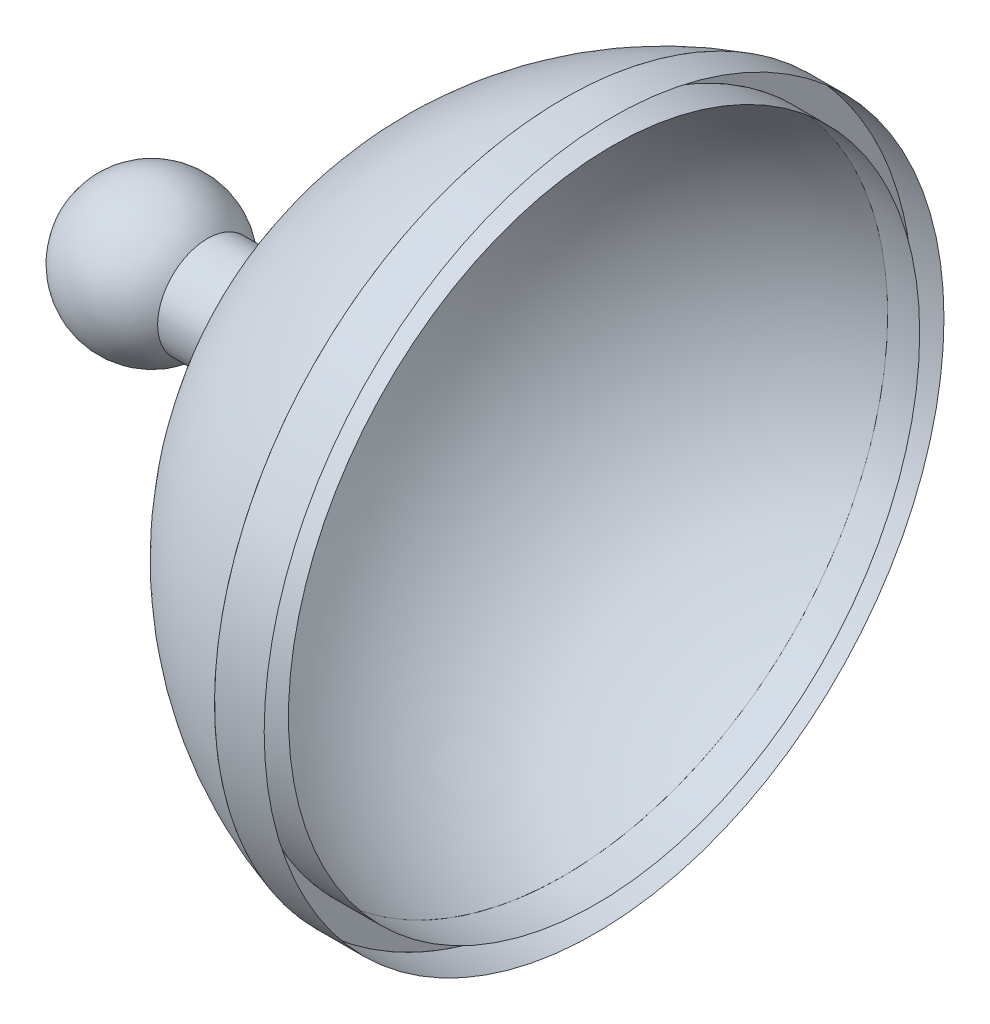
ISO-10303-21;
HEADER;
FILE_DESCRIPTION(('STEP AP214'),'2;1');
FILE_NAME('part.step','',(''),(''),'','','');
FILE_SCHEMA(('AUTOMOTIVE_DESIGN { 1 0 10303 214 1 1 1 1 }'));
ENDSEC;
DATA;
#1=APPLICATION_CONTEXT('core data for automotive mechanical design processes');
#2=APPLICATION_PROTOCOL_DEFINITION('international standard','automotive_design',2000,#1);
#3=PRODUCT_CONTEXT('',#1,'mechanical');
#4=PRODUCT('Part','Part','',(#3));
#5=PRODUCT_RELATED_PRODUCT_CATEGORY('part','',(#4));
#6=PRODUCT_DEFINITION_FORMATION('','',#4);
#7=PRODUCT_DEFINITION_CONTEXT('part definition',#1,'design');
#8=PRODUCT_DEFINITION('design','',#6,#7);
#9=PRODUCT_DEFINITION_SHAPE('','',#8);
#10=(LENGTH_UNIT() NAMED_UNIT(*) SI_UNIT(.MILLI.,.METRE.));
#11=(NAMED_UNIT(*) PLANE_ANGLE_UNIT() SI_UNIT($,.RADIAN.));
#12=(NAMED_UNIT(*) SI_UNIT($,.STERADIAN.) SOLID_ANGLE_UNIT());
#13=UNCERTAINTY_MEASURE_WITH_UNIT(LENGTH_MEASURE(1.E-05),#10,'distance_accuracy_value','');
#14=(GEOMETRIC_REPRESENTATION_CONTEXT(3) GLOBAL_UNCERTAINTY_ASSIGNED_CONTEXT((#13)) GLOBAL_UNIT_ASSIGNED_CONTEXT((#10,
#11,#12)) REPRESENTATION_CONTEXT('',''));
#15=CARTESIAN_POINT('',(0.,0.,0.));
#16=DIRECTION('',(0.,0.,1.));
#17=DIRECTION('',(1.,0.,0.));
#18=AXIS2_PLACEMENT_3D('',#15,#16,#17);
#19=CARTESIAN_POINT('',(4.26079585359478,0.,0.));
#20=DIRECTION('',(0.999660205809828,0.000144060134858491,-0.0260663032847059));
#21=DIRECTION('',(-0.0260663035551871,0.,-0.999660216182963));
#22=AXIS2_PLACEMENT_3D('',#19,#20,#21);
#23=CIRCLE('',#22,3.25);
#24=DIRECTION('',(-1.,0.,0.));
#25=VECTOR('',#24,1.);
#26=SURFACE_OF_LINEAR_EXTRUSION('',#23,#25);
#27=CARTESIAN_POINT('',(4.17608036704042,0.,-3.24889570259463));
#28=VERTEX_POINT('',#27);
#29=EDGE_CURVE('E50',#28,#28,#23,.T.);
#30=ORIENTED_EDGE('',*,*,#29,.T.);
#31=EDGE_LOOP('',(#30));
#32=FACE_BOUND('',#31,.T.);
#33=CARTESIAN_POINT('',(3.85486874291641,0.,-3.24889570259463));
#34=CARTESIAN_POINT('',(3.85486874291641,-0.089781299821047,-3.24889786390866));
#35=CARTESIAN_POINT('',(3.85486874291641,-0.17954588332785,-3.24517716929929));
#36=CARTESIAN_POINT('',(3.85486874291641,-0.358763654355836,-3.23029494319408));
#37=CARTESIAN_POINT('',(3.85486874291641,-0.448214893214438,-3.2191093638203));
#38=CARTESIAN_POINT('',(3.85486874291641,-0.625897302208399,-3.18935470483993));
#39=CARTESIAN_POINT('',(3.85486874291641,-0.714127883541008,-3.17078218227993));
#40=CARTESIAN_POINT('',(3.85486874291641,-0.97597583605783,-3.10415837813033));
#41=CARTESIAN_POINT('',(3.85486874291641,-1.14695344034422,-3.04518374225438));
#42=CARTESIAN_POINT('',(3.85486874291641,-1.47667636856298,-2.8997850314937));
#43=CARTESIAN_POINT('',(3.85486874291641,-1.63542322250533,-2.81336439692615));
#44=CARTESIAN_POINT('',(3.85486874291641,-1.93642516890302,-2.61544819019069));
#45=CARTESIAN_POINT('',(3.85486874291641,-2.07868281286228,-2.50395650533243));
#46=CARTESIAN_POINT('',(3.85486874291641,-2.34275361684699,-2.25898727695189));
#47=CARTESIAN_POINT('',(3.85486874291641,-2.46457019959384,-2.12551342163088));
#48=CARTESIAN_POINT('',(3.85486874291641,-2.6844151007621,-1.84026645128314));
#49=CARTESIAN_POINT('',(3.85486874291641,-2.78244726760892,-1.68849630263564));
#50=CARTESIAN_POINT('',(3.85486874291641,-2.95202701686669,-1.37084547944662));
#51=CARTESIAN_POINT('',(3.85486874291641,-3.02357826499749,-1.20496676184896));
#52=CARTESIAN_POINT('',(3.85486874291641,-3.13823328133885,-0.863671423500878));
#53=CARTESIAN_POINT('',(3.85486874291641,-3.18133989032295,-0.688255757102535));
#54=CARTESIAN_POINT('',(3.85486874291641,-3.23792424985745,-0.332718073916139));
#55=CARTESIAN_POINT('',(3.85486874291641,-3.25140349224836,-0.152596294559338));
#56=CARTESIAN_POINT('',(3.85486874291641,-3.24836508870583,0.20739408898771));
#57=CARTESIAN_POINT('',(3.85486874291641,-3.23184744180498,0.387262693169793));
#58=CARTESIAN_POINT('',(3.85486874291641,-3.16927182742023,0.741785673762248));
#59=CARTESIAN_POINT('',(3.85486874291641,-3.123213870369,0.916440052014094));
#60=CARTESIAN_POINT('',(3.85486874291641,-3.00283039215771,1.25571852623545));
#61=CARTESIAN_POINT('',(3.85486874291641,-2.92850489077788,1.42034262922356));
#62=CARTESIAN_POINT('',(3.85486874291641,-2.75363927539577,1.73502308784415));
#63=CARTESIAN_POINT('',(3.85486874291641,-2.65309918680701,1.88507945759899));
#64=CARTESIAN_POINT('',(3.85486874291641,-2.42857975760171,2.16649096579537));
#65=CARTESIAN_POINT('',(3.85486874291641,-2.3046004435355,2.29784612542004));
#66=CARTESIAN_POINT('',(3.85486874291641,-2.03662261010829,2.53823933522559));
#67=CARTESIAN_POINT('',(3.85486874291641,-1.89262411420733,2.64727741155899));
#68=CARTESIAN_POINT('',(3.85486874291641,-1.58857744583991,2.84003698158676));
#69=CARTESIAN_POINT('',(3.85486874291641,-1.42852929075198,2.92375850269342));
#70=CARTESIAN_POINT('',(3.85486874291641,-1.09679248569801,3.0635833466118));
#71=CARTESIAN_POINT('',(3.85486874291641,-0.925103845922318,3.11968669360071));
#72=CARTESIAN_POINT('',(3.85486874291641,-0.574813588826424,3.20273358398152));
#73=CARTESIAN_POINT('',(3.85486874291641,-0.396211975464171,3.22967714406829));
#74=CARTESIAN_POINT('',(3.85486874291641,-0.0370121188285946,3.2536643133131));
#75=CARTESIAN_POINT('',(3.85486874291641,0.143586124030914,3.250707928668));
#76=CARTESIAN_POINT('',(3.85486874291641,0.501808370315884,3.21497636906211));
#77=CARTESIAN_POINT('',(3.85486874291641,0.679432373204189,3.18220118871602));
#78=CARTESIAN_POINT('',(3.85486874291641,1.02681643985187,3.08773234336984));
#79=CARTESIAN_POINT('',(3.85486874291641,1.1965764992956,3.02603866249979));
#80=CARTESIAN_POINT('',(3.85486874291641,1.52355779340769,2.8754281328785));
#81=CARTESIAN_POINT('',(3.85486874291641,1.68077901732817,2.78651126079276));
#82=CARTESIAN_POINT('',(3.85486874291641,1.97835074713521,2.58389907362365));
#83=CARTESIAN_POINT('',(3.85486874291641,2.11870123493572,2.47020373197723));
#84=CARTESIAN_POINT('',(3.85486874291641,2.37866192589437,2.2211626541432));
#85=CARTESIAN_POINT('',(3.85486874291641,2.49827210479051,2.08581689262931));
#86=CARTESIAN_POINT('',(3.85486874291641,2.71345214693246,1.79720129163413));
#87=CARTESIAN_POINT('',(3.85486874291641,2.80902198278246,1.64393143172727));
#88=CARTESIAN_POINT('',(3.85486874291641,2.97348283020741,1.32369026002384));
#89=CARTESIAN_POINT('',(3.85486874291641,3.04237381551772,1.15671893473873));
#90=CARTESIAN_POINT('',(3.85486874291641,3.15157394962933,0.813677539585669));
#91=CARTESIAN_POINT('',(3.85486874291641,3.19188307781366,0.637607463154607));
#92=CARTESIAN_POINT('',(3.85486874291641,3.24280553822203,0.281224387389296));
#93=CARTESIAN_POINT('',(3.85486874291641,3.25341891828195,0.100911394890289));
#94=CARTESIAN_POINT('',(3.85486874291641,3.24465674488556,-0.258984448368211));
#95=CARTESIAN_POINT('',(3.85486874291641,3.22528119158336,-0.438567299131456));
#96=CARTESIAN_POINT('',(3.85486874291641,3.15707668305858,-0.79204978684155));
#97=CARTESIAN_POINT('',(3.85486874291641,3.10824773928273,-0.965949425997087));
#98=CARTESIAN_POINT('',(3.85486874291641,2.98248583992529,-1.30327041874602));
#99=CARTESIAN_POINT('',(3.85486874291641,2.90555290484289,-1.46669177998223));
#100=CARTESIAN_POINT('',(3.85486874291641,2.72570743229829,-1.77855219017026));
#101=CARTESIAN_POINT('',(3.85486874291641,2.62279492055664,-1.92699125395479));
#102=CARTESIAN_POINT('',(3.85486874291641,2.39383261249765,-2.20479826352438));
#103=CARTESIAN_POINT('',(3.85486874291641,2.26778284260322,-2.33416623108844));
#104=CARTESIAN_POINT('',(3.85486874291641,1.99601674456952,-2.57027066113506));
#105=CARTESIAN_POINT('',(3.85486874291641,1.85030043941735,-2.67700715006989));
#106=CARTESIAN_POINT('',(3.85486874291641,1.54324097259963,-2.86491065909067));
#107=CARTESIAN_POINT('',(3.85486874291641,1.3818978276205,-2.94607770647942));
#108=CARTESIAN_POINT('',(3.85486874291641,1.04794309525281,-3.08061854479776));
#109=CARTESIAN_POINT('',(3.85486874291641,0.875331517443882,-3.13399235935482));
#110=CARTESIAN_POINT('',(3.85486874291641,0.584795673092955,-3.19803272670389));
#111=CARTESIAN_POINT('',(3.85486874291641,0.468645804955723,-3.21708911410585));
#112=CARTESIAN_POINT('',(3.85486874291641,0.23498724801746,-3.24251582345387));
#113=CARTESIAN_POINT('',(3.85486874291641,0.1174793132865,-3.24889287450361));
#114=CARTESIAN_POINT('',(3.85486874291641,0.,-3.24889570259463));
#115=B_SPLINE_CURVE_WITH_KNOTS('',3,(#33,#34,#35,#36,#37,#38,#39,#40,#41,#42,#43,#44,#45,#46,
#47,#48,#49,#50,#51,#52,#53,#54,#55,#56,#57,#58,#59,#60,#61,#62,#63,#64,#65,#66,#67,#68,#69,#70,
#71,#72,#73,#74,#75,#76,#77,#78,#79,#80,#81,#82,#83,#84,#85,#86,#87,#88,#89,#90,#91,#92,#93,#94,
#95,#96,#97,#98,#99,#100,#101,#102,#103,#104,#105,#106,#107,#108,#109,#110,#111,#112,#113,#114),
.UNSPECIFIED.,.T.,.F.,(4,2,2,2,2,2,2,2,2,2,2,2,2,2,2,2,2,2,2,2,2,2,2,2,2,2,2,2,2,2,2,2,2,2,2,2,
2,2,2,2,4),(0.,0.269240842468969,0.539353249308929,0.809591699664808,1.34946189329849,
1.88926444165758,2.42898335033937,2.96861179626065,3.50815286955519,4.04761922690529,
4.58703169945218,5.12641701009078,5.66580233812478,6.20518747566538,6.74457223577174,
7.28395647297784,7.82334009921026,8.3627230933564,8.90210550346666,9.44148744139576,
9.980869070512,10.52025058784,11.0596322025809,11.5990141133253,12.1383964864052,
12.6777794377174,13.2171630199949,13.7565472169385,14.2959319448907,14.8353170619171,
15.3747013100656,15.9140855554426,16.4534695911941,16.9928532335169,17.532236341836,
18.0716188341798,18.611000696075,19.1503819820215,19.6897628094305,20.0422530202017,
20.3945561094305),.UNSPECIFIED.);
#116=CARTESIAN_POINT('',(3.85486874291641,0.,-3.24889570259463));
#117=VERTEX_POINT('',#116);
#118=EDGE_CURVE('E11',#117,#117,#115,.T.);
#119=ORIENTED_EDGE('',*,*,#118,.T.);
#120=EDGE_LOOP('',(#119));
#121=FACE_BOUND('',#120,.T.);
#122=ADVANCED_FACE('F42',(#32,#121),#26,.T.);
#123=OPEN_SHELL('',(#122));
#124=SHELL_BASED_SURFACE_MODEL('B2',(#123));
#125=CARTESIAN_POINT('',(4.26079585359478,0.,0.));
#126=DIRECTION('',(0.999660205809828,0.000144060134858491,-0.0260663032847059));
#127=DIRECTION('',(-0.0260663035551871,0.,-0.999660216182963));
#128=AXIS2_PLACEMENT_3D('',#125,#126,#127);
#129=CIRCLE('',#128,3.5);
#130=DIRECTION('',(-1.,0.,0.));
#131=VECTOR('',#130,1.);
#132=SURFACE_OF_LINEAR_EXTRUSION('',#129,#131);
#133=CARTESIAN_POINT('',(4.16956379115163,0.,-3.49881075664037));
#134=VERTEX_POINT('',#133);
#135=EDGE_CURVE('E88',#134,#134,#129,.T.);
#136=ORIENTED_EDGE('',*,*,#135,.T.);
#137=EDGE_LOOP('',(#136));
#138=FACE_BOUND('',#137,.T.);
#139=CARTESIAN_POINT('',(3.85486874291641,0.,-3.49881075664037));
#140=CARTESIAN_POINT('',(3.85486874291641,-0.0966875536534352,-3.49881308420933));
#141=CARTESIAN_POINT('',(3.85486874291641,-0.1933571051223,-3.49480618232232));
#142=CARTESIAN_POINT('',(3.85486874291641,-0.386360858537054,-3.47877916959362));
#143=CARTESIAN_POINT('',(3.85486874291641,-0.482692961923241,-3.46673316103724));
#144=CARTESIAN_POINT('',(3.85486874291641,-0.674043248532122,-3.43468968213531));
#145=CARTESIAN_POINT('',(3.85486874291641,-0.769060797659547,-3.41468850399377));
#146=CARTESIAN_POINT('',(3.85486874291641,-1.05105090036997,-3.34293979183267));
#147=CARTESIAN_POINT('',(3.85486874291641,-1.235180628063,-3.27942864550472));
#148=CARTESIAN_POINT('',(3.85486874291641,-1.59026685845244,-3.12284541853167));
#149=CARTESIAN_POINT('',(3.85486874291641,-1.76122500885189,-3.02977704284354));
#150=CARTESIAN_POINT('',(3.85486874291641,-2.08538095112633,-2.81663651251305));
#151=CARTESIAN_POINT('',(3.85486874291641,-2.23858149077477,-2.69656854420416));
#152=CARTESIAN_POINT('',(3.85486874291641,-2.52296543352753,-2.43275552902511));
#153=CARTESIAN_POINT('',(3.85486874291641,-2.65415252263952,-2.28901445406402));
#154=CARTESIAN_POINT('',(3.85486874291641,-2.89090857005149,-1.98182540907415));
#155=CARTESIAN_POINT('',(3.85486874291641,-2.99648167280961,-1.81838063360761));
#156=CARTESIAN_POINT('',(3.85486874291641,-3.17910601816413,-1.47629513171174));
#157=CARTESIAN_POINT('',(3.85486874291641,-3.25616120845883,-1.29765651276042));
#158=CARTESIAN_POINT('',(3.85486874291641,-3.37963584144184,-0.9301076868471));
#159=CARTESIAN_POINT('',(3.85486874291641,-3.42605834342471,-0.741198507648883));
#160=CARTESIAN_POINT('',(3.85486874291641,-3.48699534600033,-0.358311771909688));
#161=CARTESIAN_POINT('',(3.85486874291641,-3.50151145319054,-0.164334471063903));
#162=CARTESIAN_POINT('',(3.85486874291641,-3.49823932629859,0.223347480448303));
#163=CARTESIAN_POINT('',(3.85486874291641,-3.4804510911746,0.417052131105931));
#164=CARTESIAN_POINT('',(3.85486874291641,-3.41306196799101,0.798846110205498));
#165=CARTESIAN_POINT('',(3.85486874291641,-3.36346109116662,0.986935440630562));
#166=CARTESIAN_POINT('',(3.85486874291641,-3.23381734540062,1.3523122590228));
#167=CARTESIAN_POINT('',(3.85486874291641,-3.15377449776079,1.52959975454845));
#168=CARTESIAN_POINT('',(3.85486874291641,-2.96545768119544,1.8684864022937));
#169=CARTESIAN_POINT('',(3.85486874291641,-2.85718373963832,2.03008556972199));
#170=CARTESIAN_POINT('',(3.85486874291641,-2.61539358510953,2.33314411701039));
#171=CARTESIAN_POINT('',(3.85486874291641,-2.48187740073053,2.47460351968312));
#172=CARTESIAN_POINT('',(3.85486874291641,-2.19328588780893,2.73348851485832));
#173=CARTESIAN_POINT('',(3.85486874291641,-2.03821058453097,2.85091413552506));
#174=CARTESIAN_POINT('',(3.85486874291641,-1.71077571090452,3.05850136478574));
#175=CARTESIAN_POINT('',(3.85486874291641,-1.53841615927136,3.14866300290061));
#176=CARTESIAN_POINT('',(3.85486874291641,-1.18116113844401,3.29924360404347));
#177=CARTESIAN_POINT('',(3.85486874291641,-0.996265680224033,3.35966259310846));
#178=CARTESIAN_POINT('',(3.85486874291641,-0.619030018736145,3.44909770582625));
#179=CARTESIAN_POINT('',(3.85486874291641,-0.426689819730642,3.47811384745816));
#180=CARTESIAN_POINT('',(3.85486874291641,-0.0398592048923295,3.50394618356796));
#181=CARTESIAN_POINT('',(3.85486874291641,0.154631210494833,3.50076238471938));
#182=CARTESIAN_POINT('',(3.85486874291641,0.54040901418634,3.46228224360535));
#183=CARTESIAN_POINT('',(3.85486874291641,0.731696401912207,3.42698589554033));
#184=CARTESIAN_POINT('',(3.85486874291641,1.10580231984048,3.32525021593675));
#185=CARTESIAN_POINT('',(3.85486874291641,1.28862084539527,3.25881086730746));
#186=CARTESIAN_POINT('',(3.85486874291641,1.64075454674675,3.09661491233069));
#187=CARTESIAN_POINT('',(3.85486874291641,1.8100697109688,3.00085828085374));
#188=CARTESIAN_POINT('',(3.85486874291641,2.13053157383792,2.78266054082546));
#189=CARTESIAN_POINT('',(3.85486874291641,2.2816782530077,2.66021940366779));
#190=CARTESIAN_POINT('',(3.85486874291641,2.56163592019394,2.39202131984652));
#191=CARTESIAN_POINT('',(3.85486874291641,2.69044688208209,2.24626434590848));
#192=CARTESIAN_POINT('',(3.85486874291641,2.92217923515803,1.93544754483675));
#193=CARTESIAN_POINT('',(3.85486874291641,3.02510059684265,1.77038769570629));
#194=CARTESIAN_POINT('',(3.85486874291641,3.20221227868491,1.42551258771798));
#195=CARTESIAN_POINT('',(3.85486874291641,3.27640257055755,1.24569731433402));
#196=CARTESIAN_POINT('',(3.85486874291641,3.39400271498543,0.876268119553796));
#197=CARTESIAN_POINT('',(3.85486874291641,3.43741254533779,0.686654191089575));
#198=CARTESIAN_POINT('',(3.85486874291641,3.49225211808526,0.302857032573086));
#199=CARTESIAN_POINT('',(3.85486874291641,3.50368191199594,0.108673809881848));
#200=CARTESIAN_POINT('',(3.85486874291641,3.49424572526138,-0.278906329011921));
#201=CARTESIAN_POINT('',(3.85486874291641,3.47337974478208,-0.472303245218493));
#202=CARTESIAN_POINT('',(3.85486874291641,3.39992873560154,-0.85297669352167));
#203=CARTESIAN_POINT('',(3.85486874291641,3.34734371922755,-1.04025322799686));
#204=CARTESIAN_POINT('',(3.85486874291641,3.21190782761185,-1.40352198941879));
#205=CARTESIAN_POINT('',(3.85486874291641,3.12905697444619,-1.57951422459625));
#206=CARTESIAN_POINT('',(3.85486874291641,2.93537723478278,-1.91536389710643));
#207=CARTESIAN_POINT('',(3.85486874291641,2.82454837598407,-2.07522135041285));
#208=CARTESIAN_POINT('',(3.85486874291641,2.57797358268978,-2.37439812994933));
#209=CARTESIAN_POINT('',(3.85486874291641,2.44222767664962,-2.51371747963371));
#210=CARTESIAN_POINT('',(3.85486874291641,2.14955649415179,-2.76798378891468));
#211=CARTESIAN_POINT('',(3.85486874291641,1.99263124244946,-2.88293077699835));
#212=CARTESIAN_POINT('',(3.85486874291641,1.66195181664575,-3.08528840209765));
#213=CARTESIAN_POINT('',(3.85486874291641,1.48819766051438,-3.1726990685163));
#214=CARTESIAN_POINT('',(3.85486874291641,1.12855410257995,-3.31758920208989));
#215=CARTESIAN_POINT('',(3.85486874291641,0.942664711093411,-3.37506869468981));
#216=CARTESIAN_POINT('',(3.85486874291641,0.629779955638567,-3.44403524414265));
#217=CARTESIAN_POINT('',(3.85486874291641,0.504695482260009,-3.46455750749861));
#218=CARTESIAN_POINT('',(3.85486874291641,0.253063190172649,-3.49194011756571));
#219=CARTESIAN_POINT('',(3.85486874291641,0.126516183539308,-3.49880771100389));
#220=CARTESIAN_POINT('',(3.85486874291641,0.,-3.49881075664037));
#221=B_SPLINE_CURVE_WITH_KNOTS('',3,(#139,#140,#141,#142,#143,#144,#145,#146,#147,#148,#149,
#150,#151,#152,#153,#154,#155,#156,#157,#158,#159,#160,#161,#162,#163,#164,#165,#166,#167,#168,
#169,#170,#171,#172,#173,#174,#175,#176,#177,#178,#179,#180,#181,#182,#183,#184,#185,#186,#187,
#188,#189,#190,#191,#192,#193,#194,#195,#196,#197,#198,#199,#200,#201,#202,#203,#204,#205,#206,
#207,#208,#209,#210,#211,#212,#213,#214,#215,#216,#217,#218,#219,#220),.UNSPECIFIED.,.T.,.F.,(4,
2,2,2,2,2,2,2,2,2,2,2,2,2,2,2,2,2,2,2,2,2,2,2,2,2,2,2,2,2,2,2,2,2,2,2,2,2,2,2,4),(0.,
0.289951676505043,0.580841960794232,0.871867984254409,1.45326665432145,2.03459247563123,
2.6158282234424,3.19696654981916,3.7780107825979,4.35897455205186,4.93988029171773,
5.52075678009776,6.1016332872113,6.6825095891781,7.26338548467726,7.84426081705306,
8.4251354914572,9.00600948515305,9.58688284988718,10.1677557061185,10.7486282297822,
11.3295006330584,11.9103731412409,12.4912459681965,13.0721192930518,13.6529932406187,
14.2338678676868,14.814743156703,15.3956190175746,15.9764952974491,16.5573706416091,
17.1382459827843,17.719121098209,18.2999957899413,18.8808699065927,19.4617433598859,
20.0426161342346,20.6234882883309,21.2043599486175,21.5839647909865,21.9633681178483),.UNSPECIFIED.);
#222=CARTESIAN_POINT('',(3.85486874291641,0.,-3.49881075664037));
#223=VERTEX_POINT('',#222);
#224=EDGE_CURVE('E41',#223,#223,#221,.T.);
#225=ORIENTED_EDGE('',*,*,#224,.T.);
#226=EDGE_LOOP('',(#225));
#227=FACE_BOUND('',#226,.T.);
#228=ADVANCED_FACE('F80',(#138,#227),#132,.T.);
#229=OPEN_SHELL('',(#228));
#230=SHELL_BASED_SURFACE_MODEL('B6',(#229));
#231=CARTESIAN_POINT('',(-0.581094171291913,0.,0.));
#232=DIRECTION('',(-1.,0.,0.));
#233=DIRECTION('',(0.,0.,1.));
#234=AXIS2_PLACEMENT_3D('',#231,#232,#233);
#235=CYLINDRICAL_SURFACE('',#234,0.5);
#236=CARTESIAN_POINT('',(0.284931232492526,0.,0.));
#237=DIRECTION('',(-1.,0.,0.));
#238=DIRECTION('',(0.,0.,1.));
#239=AXIS2_PLACEMENT_3D('',#236,#237,#238);
#240=CIRCLE('',#239,0.5);
#241=CARTESIAN_POINT('',(0.284931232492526,0.,0.5));
#242=VERTEX_POINT('',#241);
#243=EDGE_CURVE('E118',#242,#242,#240,.T.);
#244=ORIENTED_EDGE('',*,*,#243,.F.);
#245=EDGE_LOOP('',(#244));
#246=FACE_BOUND('',#245,.T.);
#247=CARTESIAN_POINT('',(1.25304279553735,0.,0.));
#248=DIRECTION('',(1.,0.,0.));
#249=DIRECTION('',(0.,0.,-1.));
#250=AXIS2_PLACEMENT_3D('',#247,#248,#249);
#251=CIRCLE('',#250,0.5);
#252=CARTESIAN_POINT('',(1.25304279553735,0.5,0.));
#253=VERTEX_POINT('',#252);
#254=EDGE_CURVE('E79',#253,#253,#251,.T.);
#255=ORIENTED_EDGE('',*,*,#254,.F.);
#256=EDGE_LOOP('',(#255));
#257=FACE_BOUND('',#256,.T.);
#258=ADVANCED_FACE('F111',(#246,#257),#235,.T.);
#259=CARTESIAN_POINT('',(-0.274085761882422,0.,0.));
#260=DIRECTION('',(-1.,0.,0.));
#261=DIRECTION('',(0.,1.,0.));
#262=AXIS2_PLACEMENT_3D('',#259,#260,#261);
#263=SPHERICAL_SURFACE('',#262,0.75);
#264=ORIENTED_EDGE('',*,*,#243,.T.);
#265=EDGE_LOOP('',(#264));
#266=FACE_BOUND('',#265,.T.);
#267=ADVANCED_FACE('F113',(#266),#263,.T.);
#268=CARTESIAN_POINT('',(4.86002855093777,0.,0.));
#269=DIRECTION('',(-1.,0.,0.));
#270=DIRECTION('',(0.,1.,0.));
#271=AXIS2_PLACEMENT_3D('',#268,#269,#270);
#272=SPHERICAL_SURFACE('',#271,3.64147583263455);
#273=CARTESIAN_POINT('',(3.85486874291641,0.,0.));
#274=DIRECTION('',(-1.,0.,0.));
#275=DIRECTION('',(0.,-1.,0.));
#276=AXIS2_PLACEMENT_3D('',#273,#274,#275);
#277=CIRCLE('',#276,3.5);
#278=CARTESIAN_POINT('',(3.85486874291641,3.5,0.));
#279=VERTEX_POINT('',#278);
#280=EDGE_CURVE('E126',#279,#279,#277,.T.);
#281=CARTESIAN_POINT('',(3.85486874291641,3.5,0.));
#282=CARTESIAN_POINT('',(3.81281787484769,3.48792385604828,0.));
#283=CARTESIAN_POINT('',(3.77098486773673,3.47508919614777,0.));
#284=CARTESIAN_POINT('',(3.68780841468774,3.4479210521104,0.));
#285=CARTESIAN_POINT('',(3.64646496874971,3.43358756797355,0.));
#286=CARTESIAN_POINT('',(3.564321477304,3.40343998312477,0.));
#287=CARTESIAN_POINT('',(3.52352143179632,3.38762588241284,0.));
#288=CARTESIAN_POINT('',(3.44251770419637,3.35453771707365,0.));
#289=CARTESIAN_POINT('',(3.40231402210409,3.33726365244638,0.));
#290=CARTESIAN_POINT('',(3.32255525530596,3.30127796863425,0.));
#291=CARTESIAN_POINT('',(3.28300017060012,3.28256634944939,0.));
#292=CARTESIAN_POINT('',(3.20458997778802,3.24372987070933,0.));
#293=CARTESIAN_POINT('',(3.16573486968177,3.22360501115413,0.));
#294=CARTESIAN_POINT('',(3.08877510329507,3.18196819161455,0.));
#295=CARTESIAN_POINT('',(3.05067044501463,3.16045623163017,0.));
#296=CARTESIAN_POINT('',(2.97526107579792,3.11607315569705,0.));
#297=CARTESIAN_POINT('',(2.93795636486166,3.0932020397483,0.));
#298=CARTESIAN_POINT('',(2.86419534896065,3.04613036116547,0.));
#299=CARTESIAN_POINT('',(2.82773904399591,3.02192979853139,0.));
#300=CARTESIAN_POINT('',(2.75572219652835,2.97223066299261,0.));
#301=CARTESIAN_POINT('',(2.72016165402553,2.94673209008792,0.));
#302=CARTESIAN_POINT('',(2.64998252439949,2.89447005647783,0.));
#303=CARTESIAN_POINT('',(2.61536393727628,2.86770659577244,0.));
#304=CARTESIAN_POINT('',(2.54711368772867,2.8129495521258,0.));
#305=CARTESIAN_POINT('',(2.51348202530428,2.78495596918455,0.));
#306=CARTESIAN_POINT('',(2.44724931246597,2.7277750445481,0.));
#307=CARTESIAN_POINT('',(2.41464826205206,2.69858770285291,0.));
#308=CARTESIAN_POINT('',(2.35051912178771,2.63905717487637,0.));
#309=CARTESIAN_POINT('',(2.31899103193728,2.60871398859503,0.));
#310=CARTESIAN_POINT('',(2.25704876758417,2.54691118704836,0.));
#311=CARTESIAN_POINT('',(2.2266345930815,2.51545157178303,0.));
#312=CARTESIAN_POINT('',(2.16695966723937,2.45145677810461,0.));
#313=CARTESIAN_POINT('',(2.1376989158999,2.41892159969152,0.));
#314=CARTESIAN_POINT('',(2.08036884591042,2.35281794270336,0.));
#315=CARTESIAN_POINT('',(2.05229952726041,2.31924946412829,0.));
#316=CARTESIAN_POINT('',(1.99738878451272,2.25112281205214,0.));
#317=CARTESIAN_POINT('',(1.97054736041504,2.21656463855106,0.));
#318=CARTESIAN_POINT('',(1.9181272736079,2.14650348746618,0.));
#319=CARTESIAN_POINT('',(1.89254861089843,2.11100050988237,0.));
#320=CARTESIAN_POINT('',(1.84268727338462,2.03909586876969,0.));
#321=CARTESIAN_POINT('',(1.81840459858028,2.00269420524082,0.));
#322=CARTESIAN_POINT('',(1.77116677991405,1.92903947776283,0.));
#323=CARTESIAN_POINT('',(1.74821163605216,1.89178641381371,0.));
#324=CARTESIAN_POINT('',(1.70365869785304,1.81647727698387,0.));
#325=CARTESIAN_POINT('',(1.6820609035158,1.77842120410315,0.));
#326=CARTESIAN_POINT('',(1.6402507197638,1.70155548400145,0.));
#327=CARTESIAN_POINT('',(1.62003833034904,1.66274583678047,0.));
#328=CARTESIAN_POINT('',(1.58102521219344,1.58442338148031,0.));
#329=CARTESIAN_POINT('',(1.5622244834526,1.54491057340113,0.));
#330=CARTESIAN_POINT('',(1.52605910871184,1.46523312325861,0.));
#331=CARTESIAN_POINT('',(1.50869446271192,1.42506848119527,0.));
#332=CARTESIAN_POINT('',(1.47542380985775,1.34413953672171,0.));
#333=CARTESIAN_POINT('',(1.45951780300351,1.30337523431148,0.));
#334=CARTESIAN_POINT('',(1.42918509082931,1.22129992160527,0.));
#335=CARTESIAN_POINT('',(1.41475838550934,1.17998891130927,0.));
#336=CARTESIAN_POINT('',(1.38740301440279,1.09687384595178,0.));
#337=CARTESIAN_POINT('',(1.3744743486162,1.05506979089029,0.));
#338=CARTESIAN_POINT('',(1.35013185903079,0.971022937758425,0.));
#339=CARTESIAN_POINT('',(1.33871803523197,0.92878013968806,0.));
#340=CARTESIAN_POINT('',(1.31742002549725,0.843910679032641,0.));
#341=CARTESIAN_POINT('',(1.30753583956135,0.801284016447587,0.));
#342=CARTESIAN_POINT('',(1.28931005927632,0.715702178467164,0.));
#343=CARTESIAN_POINT('',(1.28096846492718,0.672747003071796,0.));
#344=CARTESIAN_POINT('',(1.26583827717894,0.58656401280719,0.));
#345=CARTESIAN_POINT('',(1.25904968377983,0.543336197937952,0.));
#346=CARTESIAN_POINT('',(1.25304279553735,0.5,0.));
#347=B_SPLINE_CURVE_WITH_KNOTS('',3,(#281,#282,#283,#284,#285,#286,#287,#288,#289,#290,#291,
#292,#293,#294,#295,#296,#297,#298,#299,#300,#301,#302,#303,#304,#305,#306,#307,#308,#309,#310,
#311,#312,#313,#314,#315,#316,#317,#318,#319,#320,#321,#322,#323,#324,#325,#326,#327,#328,#329,
#330,#331,#332,#333,#334,#335,#336,#337,#338,#339,#340,#341,#342,#343,#344,#345,#346),
.UNSPECIFIED.,.F.,.F.,(4,2,2,2,2,2,2,2,2,2,2,2,2,2,2,2,2,2,2,2,2,2,2,2,2,2,2,2,2,2,2,2,4),(0.,
0.13124444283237,0.26248888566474,0.393733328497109,0.524977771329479,0.656222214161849,
0.787466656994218,0.918711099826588,1.04995554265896,1.18119998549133,1.3124444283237,
1.44368887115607,1.57493331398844,1.70617775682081,1.83742219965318,1.96866664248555,
2.09991108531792,2.23115552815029,2.36239997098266,2.49364441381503,2.6248888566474,
2.75613329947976,2.88737774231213,3.01862218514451,3.14986662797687,3.28111107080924,
3.41235551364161,3.54359995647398,3.67484439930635,3.80608884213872,3.93733328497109,
4.06857772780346,4.19982217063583),.UNSPECIFIED.);
#348=EDGE_CURVE('BSEAM132',#279,#253,#347,.T.);
#349=ORIENTED_EDGE('',*,*,#280,.T.);
#350=ORIENTED_EDGE('',*,*,#254,.T.);
#351=ORIENTED_EDGE('',*,*,#348,.T.);
#352=ORIENTED_EDGE('',*,*,#348,.F.);
#353=EDGE_LOOP('',(#349,#351,#350,#352));
#354=FACE_BOUND('',#353,.T.);
#355=ADVANCED_FACE('F132',(#354),#272,.T.);
#356=CARTESIAN_POINT('',(4.63377053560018,0.,0.));
#357=DIRECTION('',(-1.,0.,0.));
#358=DIRECTION('',(0.,1.,0.));
#359=AXIS2_PLACEMENT_3D('',#356,#357,#358);
#360=SPHERICAL_SURFACE('',#359,3.34203351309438);
#361=CARTESIAN_POINT('',(3.85486874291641,0.,0.));
#362=DIRECTION('',(-1.,0.,0.));
#363=DIRECTION('',(0.,-1.,0.));
#364=AXIS2_PLACEMENT_3D('',#361,#362,#363);
#365=CIRCLE('',#364,3.25);
#366=CARTESIAN_POINT('',(3.85486874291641,-3.25,0.));
#367=VERTEX_POINT('',#366);
#368=EDGE_CURVE('E122',#367,#367,#365,.T.);
#369=ORIENTED_EDGE('',*,*,#368,.F.);
#370=EDGE_LOOP('',(#369));
#371=FACE_BOUND('',#370,.T.);
#372=ADVANCED_FACE('F137',(#371),#360,.F.);
#373=CARTESIAN_POINT('',(3.85486874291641,3.5,0.));
#374=DIRECTION('',(-1.,0.,0.));
#375=DIRECTION('',(0.,-1.,0.));
#376=AXIS2_PLACEMENT_3D('',#373,#374,#375);
#377=PLANE('',#376);
#378=ORIENTED_EDGE('',*,*,#280,.F.);
#379=EDGE_LOOP('',(#378));
#380=FACE_BOUND('',#379,.T.);
#381=ORIENTED_EDGE('',*,*,#368,.T.);
#382=EDGE_LOOP('',(#381));
#383=FACE_BOUND('',#382,.T.);
#384=ADVANCED_FACE('F134',(#380,#383),#377,.F.);
#385=CLOSED_SHELL('',(#258,#267,#355,#372,#384));
#386=MANIFOLD_SOLID_BREP('B36',#385);
#387=ADVANCED_BREP_SHAPE_REPRESENTATION('',(#18,#386),#14);
#388=MANIFOLD_SURFACE_SHAPE_REPRESENTATION('',(#18,#124,#230),#14);
#389=SHAPE_REPRESENTATION('',(#18),#14);
#390=SHAPE_DEFINITION_REPRESENTATION(#9,#389);
#391=SHAPE_REPRESENTATION_RELATIONSHIP('','',#389,#387);
#392=SHAPE_REPRESENTATION_RELATIONSHIP('','',#389,#388);
ENDSEC;
END-ISO-10303-21;
